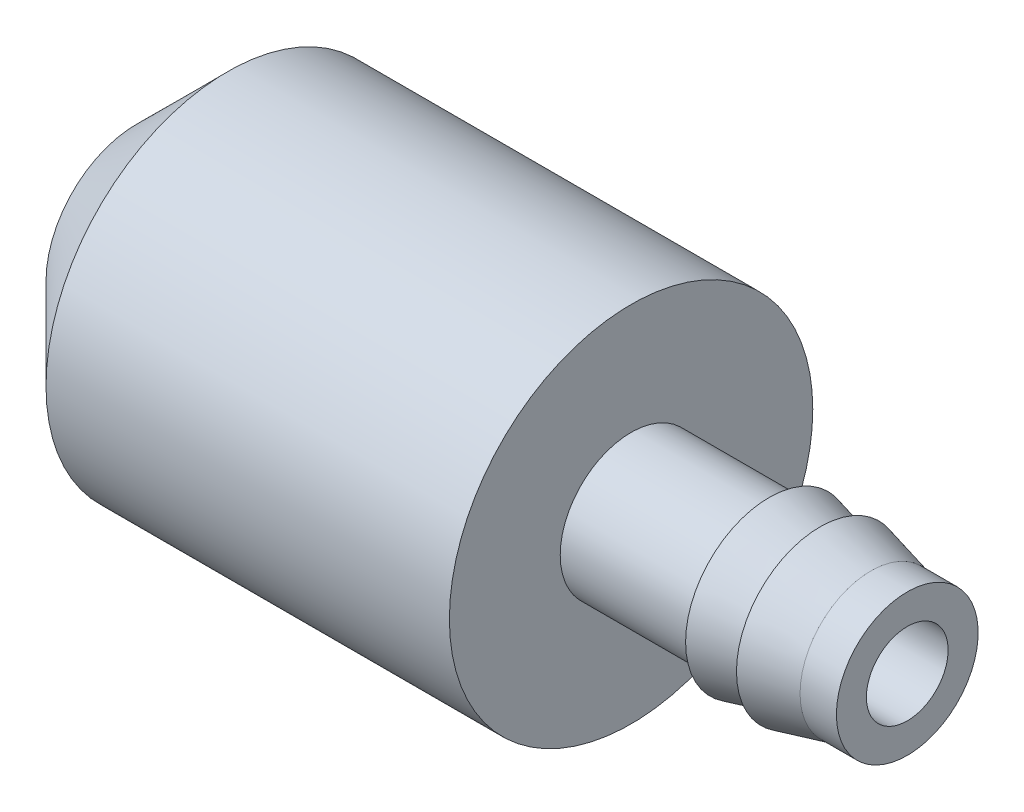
ISO-10303-21;
HEADER;
FILE_DESCRIPTION(('STEP AP214'),'2;1');
FILE_NAME('part.step','',(''),(''),'','','');
FILE_SCHEMA(('AUTOMOTIVE_DESIGN { 1 0 10303 214 1 1 1 1 }'));
ENDSEC;
DATA;
#1=APPLICATION_CONTEXT('core data for automotive mechanical design processes');
#2=APPLICATION_PROTOCOL_DEFINITION('international standard','automotive_design',2000,#1);
#3=PRODUCT_CONTEXT('',#1,'mechanical');
#4=PRODUCT('Part','Part','',(#3));
#5=PRODUCT_RELATED_PRODUCT_CATEGORY('part','',(#4));
#6=PRODUCT_DEFINITION_FORMATION('','',#4);
#7=PRODUCT_DEFINITION_CONTEXT('part definition',#1,'design');
#8=PRODUCT_DEFINITION('design','',#6,#7);
#9=PRODUCT_DEFINITION_SHAPE('','',#8);
#10=(LENGTH_UNIT() NAMED_UNIT(*) SI_UNIT(.MILLI.,.METRE.));
#11=(NAMED_UNIT(*) PLANE_ANGLE_UNIT() SI_UNIT($,.RADIAN.));
#12=(NAMED_UNIT(*) SI_UNIT($,.STERADIAN.) SOLID_ANGLE_UNIT());
#13=UNCERTAINTY_MEASURE_WITH_UNIT(LENGTH_MEASURE(1.E-05),#10,'distance_accuracy_value','');
#14=(GEOMETRIC_REPRESENTATION_CONTEXT(3) GLOBAL_UNCERTAINTY_ASSIGNED_CONTEXT((#13)) GLOBAL_UNIT_ASSIGNED_CONTEXT((#10,
#11,#12)) REPRESENTATION_CONTEXT('',''));
#15=CARTESIAN_POINT('',(0.,0.,0.));
#16=DIRECTION('',(0.,0.,1.));
#17=DIRECTION('',(1.,0.,0.));
#18=AXIS2_PLACEMENT_3D('',#15,#16,#17);
#19=CARTESIAN_POINT('',(0.,0.,0.));
#20=DIRECTION('',(-1.,0.,0.));
#21=DIRECTION('',(0.,0.,1.));
#22=AXIS2_PLACEMENT_3D('',#19,#20,#21);
#23=CYLINDRICAL_SURFACE('',#22,1.125);
#24=CARTESIAN_POINT('',(21.2,0.,0.));
#25=DIRECTION('',(-1.,0.,0.));
#26=DIRECTION('',(0.,0.,1.));
#27=AXIS2_PLACEMENT_3D('',#24,#25,#26);
#28=CIRCLE('',#27,1.125);
#29=CARTESIAN_POINT('',(21.2,0.,1.125));
#30=VERTEX_POINT('',#29);
#31=EDGE_CURVE('E74',#30,#30,#28,.T.);
#32=ORIENTED_EDGE('',*,*,#31,.F.);
#33=EDGE_LOOP('',(#32));
#34=FACE_BOUND('',#33,.T.);
#35=CARTESIAN_POINT('',(0.,0.,0.));
#36=DIRECTION('',(-1.,0.,0.));
#37=DIRECTION('',(0.,0.,1.));
#38=AXIS2_PLACEMENT_3D('',#35,#36,#37);
#39=CIRCLE('',#38,1.125);
#40=CARTESIAN_POINT('',(0.,0.,1.125));
#41=VERTEX_POINT('',#40);
#42=EDGE_CURVE('E10',#41,#41,#39,.T.);
#43=ORIENTED_EDGE('',*,*,#42,.T.);
#44=EDGE_LOOP('',(#43));
#45=FACE_BOUND('',#44,.T.);
#46=ADVANCED_FACE('F34',(#34,#45),#23,.F.);
#47=CARTESIAN_POINT('',(0.,1.125,0.));
#48=DIRECTION('',(1.,0.,0.));
#49=DIRECTION('',(0.,0.,-1.));
#50=AXIS2_PLACEMENT_3D('',#47,#48,#49);
#51=PLANE('',#50);
#52=ORIENTED_EDGE('',*,*,#42,.F.);
#53=EDGE_LOOP('',(#52));
#54=FACE_BOUND('',#53,.T.);
#55=CARTESIAN_POINT('',(0.,0.,0.));
#56=DIRECTION('',(-1.,0.,0.));
#57=DIRECTION('',(0.,0.,1.));
#58=AXIS2_PLACEMENT_3D('',#55,#56,#57);
#59=CIRCLE('',#58,2.5);
#60=CARTESIAN_POINT('',(0.,0.,2.5));
#61=VERTEX_POINT('',#60);
#62=EDGE_CURVE('E40',#61,#61,#59,.T.);
#63=ORIENTED_EDGE('',*,*,#62,.T.);
#64=EDGE_LOOP('',(#63));
#65=FACE_BOUND('',#64,.T.);
#66=ADVANCED_FACE('F81',(#54,#65),#51,.F.);
#67=CARTESIAN_POINT('',(2.50000000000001,0.,0.));
#68=DIRECTION('',(1.,0.,0.));
#69=DIRECTION('',(0.,0.,-1.));
#70=AXIS2_PLACEMENT_3D('',#67,#68,#69);
#71=CONICAL_SURFACE('',#70,5.,0.785398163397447);
#72=ORIENTED_EDGE('',*,*,#62,.F.);
#73=EDGE_LOOP('',(#72));
#74=FACE_BOUND('',#73,.T.);
#75=CARTESIAN_POINT('',(2.50000000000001,0.,0.));
#76=DIRECTION('',(-1.,0.,0.));
#77=DIRECTION('',(0.,0.,1.));
#78=AXIS2_PLACEMENT_3D('',#75,#76,#77);
#79=CIRCLE('',#78,5.);
#80=CARTESIAN_POINT('',(2.50000000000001,0.,5.));
#81=VERTEX_POINT('',#80);
#82=EDGE_CURVE('E44',#81,#81,#79,.T.);
#83=ORIENTED_EDGE('',*,*,#82,.T.);
#84=EDGE_LOOP('',(#83));
#85=FACE_BOUND('',#84,.T.);
#86=ADVANCED_FACE('F85',(#74,#85),#71,.T.);
#87=CARTESIAN_POINT('',(0.,0.,0.));
#88=DIRECTION('',(-1.,0.,0.));
#89=DIRECTION('',(0.,0.,1.));
#90=AXIS2_PLACEMENT_3D('',#87,#88,#89);
#91=CYLINDRICAL_SURFACE('',#90,5.);
#92=ORIENTED_EDGE('',*,*,#82,.F.);
#93=EDGE_LOOP('',(#92));
#94=FACE_BOUND('',#93,.T.);
#95=CARTESIAN_POINT('',(13.6,0.,0.));
#96=DIRECTION('',(-1.,0.,0.));
#97=DIRECTION('',(0.,0.,1.));
#98=AXIS2_PLACEMENT_3D('',#95,#96,#97);
#99=CIRCLE('',#98,5.);
#100=CARTESIAN_POINT('',(13.6,0.,5.));
#101=VERTEX_POINT('',#100);
#102=EDGE_CURVE('E48',#101,#101,#99,.T.);
#103=ORIENTED_EDGE('',*,*,#102,.T.);
#104=EDGE_LOOP('',(#103));
#105=FACE_BOUND('',#104,.T.);
#106=ADVANCED_FACE('F90',(#94,#105),#91,.T.);
#107=CARTESIAN_POINT('',(13.6,5.,0.));
#108=DIRECTION('',(-1.,0.,0.));
#109=DIRECTION('',(0.,0.,1.));
#110=AXIS2_PLACEMENT_3D('',#107,#108,#109);
#111=PLANE('',#110);
#112=ORIENTED_EDGE('',*,*,#102,.F.);
#113=EDGE_LOOP('',(#112));
#114=FACE_BOUND('',#113,.T.);
#115=CARTESIAN_POINT('',(13.6,0.,0.));
#116=DIRECTION('',(-1.,0.,0.));
#117=DIRECTION('',(0.,0.,1.));
#118=AXIS2_PLACEMENT_3D('',#115,#116,#117);
#119=CIRCLE('',#118,1.95);
#120=CARTESIAN_POINT('',(13.6,0.,1.95));
#121=VERTEX_POINT('',#120);
#122=EDGE_CURVE('E53',#121,#121,#119,.T.);
#123=ORIENTED_EDGE('',*,*,#122,.T.);
#124=EDGE_LOOP('',(#123));
#125=FACE_BOUND('',#124,.T.);
#126=ADVANCED_FACE('F96',(#114,#125),#111,.F.);
#127=CARTESIAN_POINT('',(0.,0.,0.));
#128=DIRECTION('',(-1.,0.,0.));
#129=DIRECTION('',(0.,0.,1.));
#130=AXIS2_PLACEMENT_3D('',#127,#128,#129);
#131=CYLINDRICAL_SURFACE('',#130,1.95);
#132=ORIENTED_EDGE('',*,*,#122,.F.);
#133=EDGE_LOOP('',(#132));
#134=FACE_BOUND('',#133,.T.);
#135=CARTESIAN_POINT('',(17.4,0.,0.));
#136=DIRECTION('',(-1.,0.,0.));
#137=DIRECTION('',(0.,0.,1.));
#138=AXIS2_PLACEMENT_3D('',#135,#136,#137);
#139=CIRCLE('',#138,1.95);
#140=CARTESIAN_POINT('',(17.4,0.,1.95));
#141=VERTEX_POINT('',#140);
#142=EDGE_CURVE('E56',#141,#141,#139,.T.);
#143=ORIENTED_EDGE('',*,*,#142,.T.);
#144=EDGE_LOOP('',(#143));
#145=FACE_BOUND('',#144,.T.);
#146=ADVANCED_FACE('F100',(#134,#145),#131,.T.);
#147=CARTESIAN_POINT('',(17.4,1.95,0.));
#148=DIRECTION('',(1.,0.,0.));
#149=DIRECTION('',(0.,0.,-1.));
#150=AXIS2_PLACEMENT_3D('',#147,#148,#149);
#151=PLANE('',#150);
#152=ORIENTED_EDGE('',*,*,#142,.F.);
#153=EDGE_LOOP('',(#152));
#154=FACE_BOUND('',#153,.T.);
#155=CARTESIAN_POINT('',(17.4,0.,0.));
#156=DIRECTION('',(-1.,0.,0.));
#157=DIRECTION('',(0.,0.,1.));
#158=AXIS2_PLACEMENT_3D('',#155,#156,#157);
#159=CIRCLE('',#158,2.3);
#160=CARTESIAN_POINT('',(17.4,0.,2.3));
#161=VERTEX_POINT('',#160);
#162=EDGE_CURVE('E59',#161,#161,#159,.T.);
#163=ORIENTED_EDGE('',*,*,#162,.T.);
#164=EDGE_LOOP('',(#163));
#165=FACE_BOUND('',#164,.T.);
#166=ADVANCED_FACE('F104',(#154,#165),#151,.F.);
#167=CARTESIAN_POINT('',(18.8,0.,0.));
#168=DIRECTION('',(-1.,0.,0.));
#169=DIRECTION('',(0.,0.,1.));
#170=AXIS2_PLACEMENT_3D('',#167,#168,#169);
#171=CONICAL_SURFACE('',#170,1.95,0.244978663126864);
#172=ORIENTED_EDGE('',*,*,#162,.F.);
#173=EDGE_LOOP('',(#172));
#174=FACE_BOUND('',#173,.T.);
#175=CARTESIAN_POINT('',(18.8,0.,0.));
#176=DIRECTION('',(-1.,0.,0.));
#177=DIRECTION('',(0.,0.,1.));
#178=AXIS2_PLACEMENT_3D('',#175,#176,#177);
#179=CIRCLE('',#178,1.95);
#180=CARTESIAN_POINT('',(18.8,0.,1.95));
#181=VERTEX_POINT('',#180);
#182=EDGE_CURVE('E62',#181,#181,#179,.T.);
#183=ORIENTED_EDGE('',*,*,#182,.T.);
#184=EDGE_LOOP('',(#183));
#185=FACE_BOUND('',#184,.T.);
#186=ADVANCED_FACE('F108',(#174,#185),#171,.T.);
#187=CARTESIAN_POINT('',(18.8,1.95,0.));
#188=DIRECTION('',(1.,0.,0.));
#189=DIRECTION('',(0.,0.,-1.));
#190=AXIS2_PLACEMENT_3D('',#187,#188,#189);
#191=PLANE('',#190);
#192=ORIENTED_EDGE('',*,*,#182,.F.);
#193=EDGE_LOOP('',(#192));
#194=FACE_BOUND('',#193,.T.);
#195=CARTESIAN_POINT('',(18.8,0.,0.));
#196=DIRECTION('',(-1.,0.,0.));
#197=DIRECTION('',(0.,0.,1.));
#198=AXIS2_PLACEMENT_3D('',#195,#196,#197);
#199=CIRCLE('',#198,2.3);
#200=CARTESIAN_POINT('',(18.8,0.,2.3));
#201=VERTEX_POINT('',#200);
#202=EDGE_CURVE('E65',#201,#201,#199,.T.);
#203=ORIENTED_EDGE('',*,*,#202,.T.);
#204=EDGE_LOOP('',(#203));
#205=FACE_BOUND('',#204,.T.);
#206=ADVANCED_FACE('F112',(#194,#205),#191,.F.);
#207=CARTESIAN_POINT('',(20.2,0.,0.));
#208=DIRECTION('',(-1.,0.,0.));
#209=DIRECTION('',(0.,0.,1.));
#210=AXIS2_PLACEMENT_3D('',#207,#208,#209);
#211=CONICAL_SURFACE('',#210,1.95,0.244978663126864);
#212=ORIENTED_EDGE('',*,*,#202,.F.);
#213=EDGE_LOOP('',(#212));
#214=FACE_BOUND('',#213,.T.);
#215=CARTESIAN_POINT('',(20.2,0.,0.));
#216=DIRECTION('',(-1.,0.,0.));
#217=DIRECTION('',(0.,0.,1.));
#218=AXIS2_PLACEMENT_3D('',#215,#216,#217);
#219=CIRCLE('',#218,1.95);
#220=CARTESIAN_POINT('',(20.2,0.,1.95));
#221=VERTEX_POINT('',#220);
#222=EDGE_CURVE('E68',#221,#221,#219,.T.);
#223=ORIENTED_EDGE('',*,*,#222,.T.);
#224=EDGE_LOOP('',(#223));
#225=FACE_BOUND('',#224,.T.);
#226=ADVANCED_FACE('F116',(#214,#225),#211,.T.);
#227=CARTESIAN_POINT('',(0.,0.,0.));
#228=DIRECTION('',(-1.,0.,0.));
#229=DIRECTION('',(0.,0.,1.));
#230=AXIS2_PLACEMENT_3D('',#227,#228,#229);
#231=CYLINDRICAL_SURFACE('',#230,1.95);
#232=ORIENTED_EDGE('',*,*,#222,.F.);
#233=EDGE_LOOP('',(#232));
#234=FACE_BOUND('',#233,.T.);
#235=CARTESIAN_POINT('',(21.2,0.,0.));
#236=DIRECTION('',(-1.,0.,0.));
#237=DIRECTION('',(0.,0.,1.));
#238=AXIS2_PLACEMENT_3D('',#235,#236,#237);
#239=CIRCLE('',#238,1.95);
#240=CARTESIAN_POINT('',(21.2,0.,1.95));
#241=VERTEX_POINT('',#240);
#242=EDGE_CURVE('E71',#241,#241,#239,.T.);
#243=ORIENTED_EDGE('',*,*,#242,.T.);
#244=EDGE_LOOP('',(#243));
#245=FACE_BOUND('',#244,.T.);
#246=ADVANCED_FACE('F120',(#234,#245),#231,.T.);
#247=CARTESIAN_POINT('',(21.2,1.95,0.));
#248=DIRECTION('',(-1.,0.,0.));
#249=DIRECTION('',(0.,0.,1.));
#250=AXIS2_PLACEMENT_3D('',#247,#248,#249);
#251=PLANE('',#250);
#252=ORIENTED_EDGE('',*,*,#242,.F.);
#253=EDGE_LOOP('',(#252));
#254=FACE_BOUND('',#253,.T.);
#255=ORIENTED_EDGE('',*,*,#31,.T.);
#256=EDGE_LOOP('',(#255));
#257=FACE_BOUND('',#256,.T.);
#258=ADVANCED_FACE('F78',(#254,#257),#251,.F.);
#259=CLOSED_SHELL('',(#46,#66,#86,#106,#126,#146,#166,#186,#206,#226,#246,#258));
#260=MANIFOLD_SOLID_BREP('B2',#259);
#261=ADVANCED_BREP_SHAPE_REPRESENTATION('',(#18,#260),#14);
#262=SHAPE_DEFINITION_REPRESENTATION(#9,#261);
ENDSEC;
END-ISO-10303-21;
